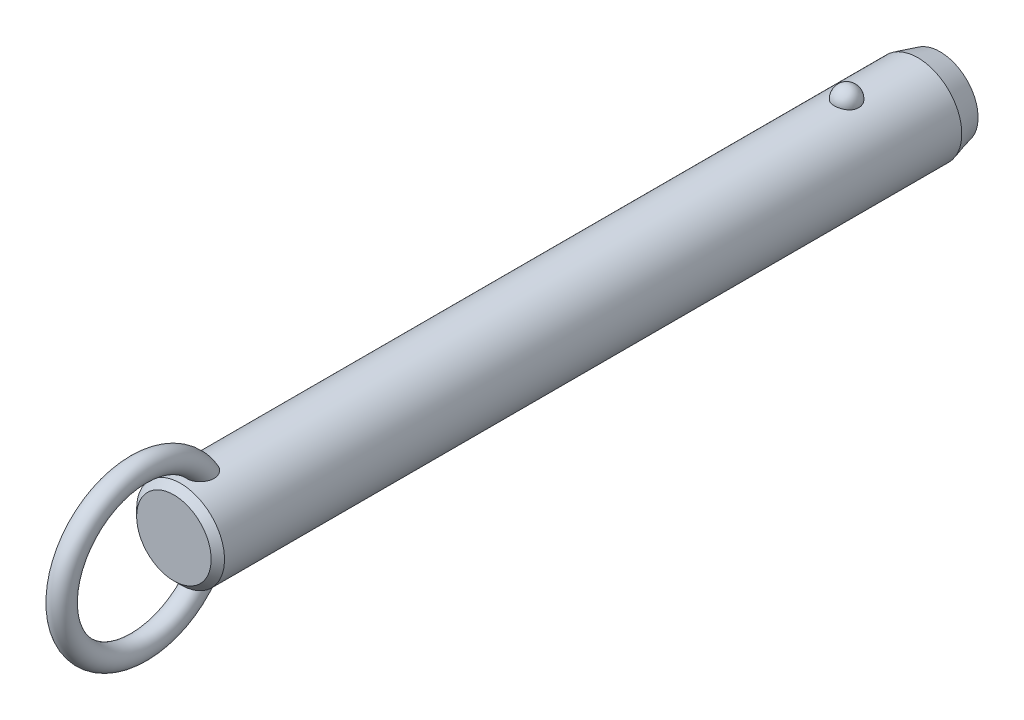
ISO-10303-21;
HEADER;
FILE_DESCRIPTION(('STEP AP214'),'2;1');
FILE_NAME('part.step','',(''),(''),'','','');
FILE_SCHEMA(('AUTOMOTIVE_DESIGN { 1 0 10303 214 1 1 1 1 }'));
ENDSEC;
DATA;
#1=APPLICATION_CONTEXT('core data for automotive mechanical design processes');
#2=APPLICATION_PROTOCOL_DEFINITION('international standard','automotive_design',2000,#1);
#3=PRODUCT_CONTEXT('',#1,'mechanical');
#4=PRODUCT('Part','Part','',(#3));
#5=PRODUCT_RELATED_PRODUCT_CATEGORY('part','',(#4));
#6=PRODUCT_DEFINITION_FORMATION('','',#4);
#7=PRODUCT_DEFINITION_CONTEXT('part definition',#1,'design');
#8=PRODUCT_DEFINITION('design','',#6,#7);
#9=PRODUCT_DEFINITION_SHAPE('','',#8);
#10=(LENGTH_UNIT() NAMED_UNIT(*) SI_UNIT(.MILLI.,.METRE.));
#11=(NAMED_UNIT(*) PLANE_ANGLE_UNIT() SI_UNIT($,.RADIAN.));
#12=(NAMED_UNIT(*) SI_UNIT($,.STERADIAN.) SOLID_ANGLE_UNIT());
#13=UNCERTAINTY_MEASURE_WITH_UNIT(LENGTH_MEASURE(1.E-05),#10,'distance_accuracy_value','');
#14=(GEOMETRIC_REPRESENTATION_CONTEXT(3) GLOBAL_UNCERTAINTY_ASSIGNED_CONTEXT((#13)) GLOBAL_UNIT_ASSIGNED_CONTEXT((#10,
#11,#12)) REPRESENTATION_CONTEXT('',''));
#15=CARTESIAN_POINT('',(0.,0.,0.));
#16=DIRECTION('',(0.,0.,1.));
#17=DIRECTION('',(1.,0.,0.));
#18=AXIS2_PLACEMENT_3D('',#15,#16,#17);
#19=CARTESIAN_POINT('',(0.,0.,109.2));
#20=DIRECTION('',(0.,0.,-1.));
#21=DIRECTION('',(-1.,0.,0.));
#22=AXIS2_PLACEMENT_3D('',#19,#20,#21);
#23=CYLINDRICAL_SURFACE('',#22,7.9);
#24=CARTESIAN_POINT('',(2.1785689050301,7.59367088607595,-2.19999999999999));
#25=CARTESIAN_POINT('',(2.17856679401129,7.59367269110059,-2.07701843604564));
#26=CARTESIAN_POINT('',(2.16853481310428,7.59657145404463,-1.95401006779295));
#27=CARTESIAN_POINT('',(2.12864689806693,7.607843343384,-1.71147811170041));
#28=CARTESIAN_POINT('',(2.09878338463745,7.61621856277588,-1.59195587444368));
#29=CARTESIAN_POINT('',(2.0199931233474,7.63749180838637,-1.3598563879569));
#30=CARTESIAN_POINT('',(1.97107475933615,7.6503878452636,-1.24727610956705));
#31=CARTESIAN_POINT('',(1.85539377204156,7.67926115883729,-1.03213234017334));
#32=CARTESIAN_POINT('',(1.78863158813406,7.69523835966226,-0.929568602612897));
#33=CARTESIAN_POINT('',(1.63856494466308,7.7285848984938,-0.736786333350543));
#34=CARTESIAN_POINT('',(1.55518140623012,7.7459606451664,-0.646630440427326));
#35=CARTESIAN_POINT('',(1.37422937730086,7.78009978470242,-0.481747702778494));
#36=CARTESIAN_POINT('',(1.27666086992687,7.79686317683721,-0.407020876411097));
#37=CARTESIAN_POINT('',(1.07024728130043,7.82786153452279,-0.275278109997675));
#38=CARTESIAN_POINT('',(0.961434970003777,7.84210353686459,-0.218212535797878));
#39=CARTESIAN_POINT('',(0.735351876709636,7.86652194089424,-0.123146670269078));
#40=CARTESIAN_POINT('',(0.618082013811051,7.87669878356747,-0.085144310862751));
#41=CARTESIAN_POINT('',(0.380637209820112,7.89170521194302,-0.0298158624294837));
#42=CARTESIAN_POINT('',(0.260550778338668,7.89662650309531,-0.0121347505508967));
#43=CARTESIAN_POINT('',(0.0190117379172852,7.90090003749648,0.00324379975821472));
#44=CARTESIAN_POINT('',(-0.102440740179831,7.90025280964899,0.00094313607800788));
#45=CARTESIAN_POINT('',(-0.341452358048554,7.89351056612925,-0.0233955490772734));
#46=CARTESIAN_POINT('',(-0.459042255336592,7.88749257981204,-0.0451545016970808));
#47=CARTESIAN_POINT('',(-0.688796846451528,7.87075812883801,-0.107408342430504));
#48=CARTESIAN_POINT('',(-0.800961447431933,7.86004158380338,-0.147903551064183));
#49=CARTESIAN_POINT('',(-1.01743634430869,7.83497131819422,-0.246799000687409));
#50=CARTESIAN_POINT('',(-1.12169791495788,7.82059709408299,-0.305300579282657));
#51=CARTESIAN_POINT('',(-1.31891765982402,7.78976470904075,-0.438549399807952));
#52=CARTESIAN_POINT('',(-1.41187469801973,7.77330633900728,-0.513298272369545));
#53=CARTESIAN_POINT('',(-1.58577142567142,7.73972434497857,-0.678622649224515));
#54=CARTESIAN_POINT('',(-1.66645140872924,7.72259402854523,-0.769470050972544));
#55=CARTESIAN_POINT('',(-1.81161503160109,7.68983776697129,-0.963538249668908));
#56=CARTESIAN_POINT('',(-1.87609753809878,7.6742119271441,-1.06675991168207));
#57=CARTESIAN_POINT('',(-1.98790138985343,7.6460202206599,-1.28401170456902));
#58=CARTESIAN_POINT('',(-2.03501994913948,7.63349104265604,-1.39815107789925));
#59=CARTESIAN_POINT('',(-2.10986724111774,7.6131449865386,-1.63301784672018));
#60=CARTESIAN_POINT('',(-2.1375965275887,7.60532797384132,-1.75374505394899));
#61=CARTESIAN_POINT('',(-2.17289256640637,7.5953195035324,-1.99782562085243));
#62=CARTESIAN_POINT('',(-2.18054294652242,7.59310471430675,-2.12116592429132));
#63=CARTESIAN_POINT('',(-2.17572919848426,7.59448538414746,-2.36741799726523));
#64=CARTESIAN_POINT('',(-2.1632656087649,7.59808068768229,-2.49032977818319));
#65=CARTESIAN_POINT('',(-2.11865035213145,7.61064035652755,-2.73161015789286));
#66=CARTESIAN_POINT('',(-2.08659579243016,7.61957823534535,-2.84999812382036));
#67=CARTESIAN_POINT('',(-2.00367799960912,7.64179982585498,-3.07955956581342));
#68=CARTESIAN_POINT('',(-1.9528140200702,7.65508371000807,-3.19073275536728));
#69=CARTESIAN_POINT('',(-1.83321113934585,7.68460381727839,-3.40337899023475));
#70=CARTESIAN_POINT('',(-1.76437735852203,7.70085556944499,-3.50479651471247));
#71=CARTESIAN_POINT('',(-1.61069526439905,7.73445734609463,-3.69446912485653));
#72=CARTESIAN_POINT('',(-1.52584634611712,7.75180741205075,-3.78272371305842));
#73=CARTESIAN_POINT('',(-1.34198059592,7.78574608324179,-3.94393987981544));
#74=CARTESIAN_POINT('',(-1.24291308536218,7.80233167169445,-4.01684434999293));
#75=CARTESIAN_POINT('',(-1.03352039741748,7.83281625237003,-4.14489386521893));
#76=CARTESIAN_POINT('',(-0.92319600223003,7.84671543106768,-4.20004014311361));
#77=CARTESIAN_POINT('',(-0.695822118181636,7.87011575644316,-4.29042017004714));
#78=CARTESIAN_POINT('',(-0.578872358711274,7.87966903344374,-4.32589112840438));
#79=CARTESIAN_POINT('',(-0.340410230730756,7.8935652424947,-4.37692226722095));
#80=CARTESIAN_POINT('',(-0.218898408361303,7.89790879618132,-4.39248482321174));
#81=CARTESIAN_POINT('',(0.0228107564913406,7.90087453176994,-4.40314405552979));
#82=CARTESIAN_POINT('',(0.142990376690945,7.89960185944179,-4.39861683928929));
#83=CARTESIAN_POINT('',(0.380829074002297,7.89171262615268,-4.37008293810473));
#84=CARTESIAN_POINT('',(0.498488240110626,7.8850962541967,-4.34607694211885));
#85=CARTESIAN_POINT('',(0.727535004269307,7.86726442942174,-4.27939317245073));
#86=CARTESIAN_POINT('',(0.838944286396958,7.85606616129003,-4.236785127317));
#87=CARTESIAN_POINT('',(1.05295421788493,7.83025654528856,-4.13408348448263));
#88=CARTESIAN_POINT('',(1.15555431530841,7.81564498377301,-4.07398879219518));
#89=CARTESIAN_POINT('',(1.35076763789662,7.7843022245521,-3.93687432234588));
#90=CARTESIAN_POINT('',(1.4432046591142,7.76754209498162,-3.85961036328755));
#91=CARTESIAN_POINT('',(1.6139111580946,7.73387857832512,-3.69076949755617));
#92=CARTESIAN_POINT('',(1.6921781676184,7.71697516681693,-3.59919010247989));
#93=CARTESIAN_POINT('',(1.83380875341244,7.6845643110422,-3.40247278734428));
#94=CARTESIAN_POINT('',(1.89689280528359,7.66908588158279,-3.29712873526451));
#95=CARTESIAN_POINT('',(2.0047823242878,7.64159441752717,-3.07707931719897));
#96=CARTESIAN_POINT('',(2.0495945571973,7.62958010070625,-2.96237743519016));
#97=CARTESIAN_POINT('',(2.11580183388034,7.61146617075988,-2.74040519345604));
#98=CARTESIAN_POINT('',(2.13929812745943,7.60484503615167,-2.63379846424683));
#99=CARTESIAN_POINT('',(2.17068242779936,7.59594664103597,-2.41813481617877));
#100=CARTESIAN_POINT('',(2.17857077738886,7.59366928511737,-2.30907795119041));
#101=CARTESIAN_POINT('',(2.1785689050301,7.59367088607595,-2.19999999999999));
#102=B_SPLINE_CURVE_WITH_KNOTS('',3,(#24,#25,#26,#27,#28,#29,#30,#31,#32,#33,#34,#35,#36,#37,
#38,#39,#40,#41,#42,#43,#44,#45,#46,#47,#48,#49,#50,#51,#52,#53,#54,#55,#56,#57,#58,#59,#60,#61,
#62,#63,#64,#65,#66,#67,#68,#69,#70,#71,#72,#73,#74,#75,#76,#77,#78,#79,#80,#81,#82,#83,#84,#85,
#86,#87,#88,#89,#90,#91,#92,#93,#94,#95,#96,#97,#98,#99,#100,#101),.UNSPECIFIED.,.T.,.F.,(4,2,2,
2,2,2,2,2,2,2,2,2,2,2,2,2,2,2,2,2,2,2,2,2,2,2,2,2,2,2,2,2,2,2,2,2,2,2,4),(0.,0.368552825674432,
0.737246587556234,1.10577831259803,1.4743009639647,1.8446206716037,2.21494081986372,
2.5842105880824,2.95344028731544,3.31611630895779,3.67875788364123,4.03628044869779,
4.39380913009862,4.75338791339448,5.11300280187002,5.47939989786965,5.8458226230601,
6.21639834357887,6.58696347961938,6.95598276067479,7.32499216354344,7.69218715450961,
8.0593967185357,8.42858578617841,8.79778880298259,9.16834203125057,9.5388695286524,
9.90482699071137,10.2707407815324,10.6298333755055,10.9889132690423,11.3466585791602,
11.7044262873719,12.0676511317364,12.4309391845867,12.8004764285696,13.1698767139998,
13.4967701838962,13.8236564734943),.UNSPECIFIED.);
#103=CARTESIAN_POINT('',(2.1785689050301,7.59367088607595,-2.19999999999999));
#104=VERTEX_POINT('',#103);
#105=EDGE_CURVE('E41',#104,#104,#102,.T.);
#106=ORIENTED_EDGE('',*,*,#105,.T.);
#107=EDGE_LOOP('',(#106));
#108=FACE_BOUND('',#107,.T.);
#109=CARTESIAN_POINT('',(0.,0.,117.52));
#110=DIRECTION('',(0.,0.,1.));
#111=DIRECTION('',(1.,0.,0.));
#112=AXIS2_PLACEMENT_3D('',#109,#110,#111);
#113=CIRCLE('',#112,7.9);
#114=CARTESIAN_POINT('',(-7.90000000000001,0.,117.52));
#115=VERTEX_POINT('',#114);
#116=EDGE_CURVE('E10',#115,#115,#113,.F.);
#117=ORIENTED_EDGE('',*,*,#116,.T.);
#118=EDGE_LOOP('',(#117));
#119=FACE_BOUND('',#118,.T.);
#120=CARTESIAN_POINT('',(-0.630969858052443,-7.87476203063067,111.412432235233));
#121=CARTESIAN_POINT('',(-0.734180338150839,-7.8664899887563,111.447285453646));
#122=CARTESIAN_POINT('',(-0.834476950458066,-7.85639291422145,111.490816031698));
#123=CARTESIAN_POINT('',(-1.0262035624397,-7.83366343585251,111.594094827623));
#124=CARTESIAN_POINT('',(-1.1176141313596,-7.82102565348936,111.653877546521));
#125=CARTESIAN_POINT('',(-1.28877277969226,-7.79464922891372,111.787839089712));
#126=CARTESIAN_POINT('',(-1.36854014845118,-7.78091246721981,111.861993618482));
#127=CARTESIAN_POINT('',(-1.5146152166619,-7.75380398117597,112.022494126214));
#128=CARTESIAN_POINT('',(-1.58092966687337,-7.74043207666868,112.108833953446));
#129=CARTESIAN_POINT('',(-1.70019064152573,-7.71512522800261,112.292978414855));
#130=CARTESIAN_POINT('',(-1.75284037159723,-7.70322473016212,112.390979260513));
#131=CARTESIAN_POINT('',(-1.84263464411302,-7.68224112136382,112.594102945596));
#132=CARTESIAN_POINT('',(-1.87977299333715,-7.6731591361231,112.699228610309));
#133=CARTESIAN_POINT('',(-1.94152728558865,-7.65777930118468,112.923284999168));
#134=CARTESIAN_POINT('',(-1.96475471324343,-7.65179654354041,113.042616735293));
#135=CARTESIAN_POINT('',(-1.99449499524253,-7.64409642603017,113.28342986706));
#136=CARTESIAN_POINT('',(-2.0010005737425,-7.64238092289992,113.404912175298));
#137=CARTESIAN_POINT('',(-1.99856014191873,-7.64302120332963,113.668340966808));
#138=CARTESIAN_POINT('',(-1.98680021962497,-7.64611845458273,113.81025654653));
#139=CARTESIAN_POINT('',(-1.9445777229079,-7.65696186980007,114.091118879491));
#140=CARTESIAN_POINT('',(-1.91409393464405,-7.66471330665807,114.230062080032));
#141=CARTESIAN_POINT('',(-1.82768670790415,-7.68582947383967,114.531939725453));
#142=CARTESIAN_POINT('',(-1.76772963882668,-7.70003779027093,114.693686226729));
#143=CARTESIAN_POINT('',(-1.65998501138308,-7.72371550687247,114.927695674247));
#144=CARTESIAN_POINT('',(-1.62107967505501,-7.73200670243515,115.004297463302));
#145=CARTESIAN_POINT('',(-1.53727726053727,-7.74910377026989,115.154079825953));
#146=CARTESIAN_POINT('',(-1.49238215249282,-7.75790947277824,115.227261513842));
#147=CARTESIAN_POINT('',(-1.3739705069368,-7.77993338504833,115.40288382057));
#148=CARTESIAN_POINT('',(-1.29690364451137,-7.79328473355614,115.502955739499));
#149=CARTESIAN_POINT('',(-1.1288548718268,-7.81939266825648,115.690714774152));
#150=CARTESIAN_POINT('',(-1.03789926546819,-7.83215032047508,115.778424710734));
#151=CARTESIAN_POINT('',(-0.869532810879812,-7.85231710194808,115.913414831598));
#152=CARTESIAN_POINT('',(-0.795716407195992,-7.86021093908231,115.965076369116));
#153=CARTESIAN_POINT('',(-0.64081313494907,-7.87434920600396,116.056381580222));
#154=CARTESIAN_POINT('',(-0.559737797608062,-7.88059619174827,116.09604389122));
#155=CARTESIAN_POINT('',(-0.406456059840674,-7.88984116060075,116.154300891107));
#156=CARTESIAN_POINT('',(-0.335227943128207,-7.89321892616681,116.175384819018));
#157=CARTESIAN_POINT('',(-0.190193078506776,-7.89804235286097,116.20541418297));
#158=CARTESIAN_POINT('',(-0.116388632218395,-7.89948969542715,116.214370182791));
#159=CARTESIAN_POINT('',(0.0318414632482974,-7.90028409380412,116.219291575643));
#160=CARTESIAN_POINT('',(0.106268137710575,-7.89962640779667,116.215227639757));
#161=CARTESIAN_POINT('',(0.2532906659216,-7.8962818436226,116.194461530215));
#162=CARTESIAN_POINT('',(0.325885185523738,-7.8935935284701,116.177750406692));
#163=CARTESIAN_POINT('',(0.4814417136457,-7.88577340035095,116.128738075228));
#164=CARTESIAN_POINT('',(0.563611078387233,-7.88026321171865,116.094005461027));
#165=CARTESIAN_POINT('',(0.721129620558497,-7.86741729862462,116.011796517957));
#166=CARTESIAN_POINT('',(0.79646633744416,-7.86007832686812,115.964297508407));
#167=CARTESIAN_POINT('',(0.971456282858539,-7.84073285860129,115.836513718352));
#168=CARTESIAN_POINT('',(1.06719686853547,-7.82809461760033,115.751004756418));
#169=CARTESIAN_POINT('',(1.24418921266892,-7.80192439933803,115.566232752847));
#170=CARTESIAN_POINT('',(1.32540832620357,-7.78839049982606,115.466939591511));
#171=CARTESIAN_POINT('',(1.45199971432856,-7.76559693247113,115.289576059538));
#172=CARTESIAN_POINT('',(1.50085649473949,-7.75626094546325,115.213954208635));
#173=CARTESIAN_POINT('',(1.59197749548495,-7.7380727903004,115.058742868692));
#174=CARTESIAN_POINT('',(1.63423919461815,-7.72922080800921,114.979151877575));
#175=CARTESIAN_POINT('',(1.7122261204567,-7.71231959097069,114.816664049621));
#176=CARTESIAN_POINT('',(1.74794516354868,-7.70427111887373,114.733764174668));
#177=CARTESIAN_POINT('',(1.81270113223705,-7.68929240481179,114.5652967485));
#178=CARTESIAN_POINT('',(1.84173789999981,-7.68236218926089,114.479729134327));
#179=CARTESIAN_POINT('',(1.89322698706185,-7.6698375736,114.30528702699));
#180=CARTESIAN_POINT('',(1.91558744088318,-7.66426199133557,114.216383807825));
#181=CARTESIAN_POINT('',(1.95281367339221,-7.65485915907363,114.036969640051));
#182=CARTESIAN_POINT('',(1.96767946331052,-7.65103190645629,113.946458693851));
#183=CARTESIAN_POINT('',(2.00021456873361,-7.64262981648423,113.673732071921));
#184=CARTESIAN_POINT('',(2.00600691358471,-7.6410871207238,113.489709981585));
#185=CARTESIAN_POINT('',(1.98445334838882,-7.64669564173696,113.176501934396));
#186=CARTESIAN_POINT('',(1.96607186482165,-7.65149688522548,113.046618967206));
#187=CARTESIAN_POINT('',(1.90884967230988,-7.6659762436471,112.791632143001));
#188=CARTESIAN_POINT('',(1.87002101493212,-7.67565148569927,112.666525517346));
#189=CARTESIAN_POINT('',(1.77063986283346,-7.69918471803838,112.42454013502));
#190=CARTESIAN_POINT('',(1.70993724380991,-7.71307150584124,112.307725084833));
#191=CARTESIAN_POINT('',(1.56733070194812,-7.74330306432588,112.088144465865));
#192=CARTESIAN_POINT('',(1.48543692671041,-7.75964665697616,111.985372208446));
#193=CARTESIAN_POINT('',(1.31346177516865,-7.79047523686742,111.809380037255));
#194=CARTESIAN_POINT('',(1.22547278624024,-7.80495298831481,111.734106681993));
#195=CARTESIAN_POINT('',(1.03724352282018,-7.83218597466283,111.600486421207));
#196=CARTESIAN_POINT('',(0.937008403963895,-7.84494192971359,111.542132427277));
#197=CARTESIAN_POINT('',(0.733599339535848,-7.86649045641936,111.447027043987));
#198=CARTESIAN_POINT('',(0.630941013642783,-7.87547134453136,111.409210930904));
#199=CARTESIAN_POINT('',(0.420465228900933,-7.88950708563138,111.351116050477));
#200=CARTESIAN_POINT('',(0.312645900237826,-7.89456050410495,111.33084369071));
#201=CARTESIAN_POINT('',(0.0960869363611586,-7.9001518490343,111.308455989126));
#202=CARTESIAN_POINT('',(-0.0126341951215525,-7.90073226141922,111.306169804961));
#203=CARTESIAN_POINT('',(-0.228766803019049,-7.89742350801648,111.319367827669));
#204=CARTESIAN_POINT('',(-0.33618060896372,-7.89354403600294,111.334813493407));
#205=CARTESIAN_POINT('',(-0.473410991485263,-7.88586871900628,111.366217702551));
#206=CARTESIAN_POINT('',(-0.505257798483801,-7.88388984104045,111.374354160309));
#207=CARTESIAN_POINT('',(-0.568481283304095,-7.87958326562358,111.392208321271));
#208=CARTESIAN_POINT('',(-0.599857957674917,-7.87725556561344,111.401926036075));
#209=CARTESIAN_POINT('',(-0.630969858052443,-7.87476203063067,111.412432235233));
#210=B_SPLINE_CURVE_WITH_KNOTS('',3,(#120,#121,#122,#123,#124,#125,#126,#127,#128,#129,#130,
#131,#132,#133,#134,#135,#136,#137,#138,#139,#140,#141,#142,#143,#144,#145,#146,#147,#148,#149,
#150,#151,#152,#153,#154,#155,#156,#157,#158,#159,#160,#161,#162,#163,#164,#165,#166,#167,#168,
#169,#170,#171,#172,#173,#174,#175,#176,#177,#178,#179,#180,#181,#182,#183,#184,#185,#186,#187,
#188,#189,#190,#191,#192,#193,#194,#195,#196,#197,#198,#199,#200,#201,#202,#203,#204,#205,#206,
#207,#208,#209),.UNSPECIFIED.,.T.,.F.,(4,2,2,2,2,2,2,2,2,2,2,2,2,2,2,2,2,2,2,2,2,2,2,2,2,2,2,2,
2,2,2,2,2,2,2,2,2,2,2,2,2,2,2,2,4),(0.,0.327622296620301,0.655945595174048,0.983718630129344,
1.3113267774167,1.64554655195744,1.9798996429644,2.34365728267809,2.70757317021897,
3.13333684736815,3.55958380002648,4.07655306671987,4.33527897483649,4.59391999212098,
4.9738243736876,5.35301797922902,5.62348245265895,5.89352465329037,6.11565959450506,
6.3376009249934,6.56004255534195,6.782641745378,7.04930844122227,7.31645206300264,
7.70130871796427,8.08701995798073,8.35824509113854,8.62957365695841,8.90115735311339,
9.17274746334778,9.44791855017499,9.72308922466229,10.2715298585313,10.6638393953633,
11.0559179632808,11.4507403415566,11.845374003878,12.1936425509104,12.5417649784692,
12.8695063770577,13.1973674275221,13.5221104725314,13.8461490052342,13.9449071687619,
14.0436660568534),.UNSPECIFIED.);
#211=CARTESIAN_POINT('',(-0.630969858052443,-7.87476203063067,111.412432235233));
#212=VERTEX_POINT('',#211);
#213=EDGE_CURVE('E59',#212,#212,#210,.T.);
#214=ORIENTED_EDGE('',*,*,#213,.T.);
#215=EDGE_LOOP('',(#214));
#216=FACE_BOUND('',#215,.T.);
#217=CARTESIAN_POINT('',(-0.630969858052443,7.87476203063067,111.412432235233));
#218=CARTESIAN_POINT('',(-0.52891882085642,7.88293636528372,111.377979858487));
#219=CARTESIAN_POINT('',(-0.423745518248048,7.8893481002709,111.351915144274));
#220=CARTESIAN_POINT('',(-0.210236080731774,7.8979273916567,111.317282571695));
#221=CARTESIAN_POINT('',(-0.101893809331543,7.90008607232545,111.308751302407));
#222=CARTESIAN_POINT('',(0.114660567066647,7.89990877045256,111.309457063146));
#223=CARTESIAN_POINT('',(0.222872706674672,7.89757640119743,111.31867980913));
#224=CARTESIAN_POINT('',(0.436107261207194,7.88867538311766,111.354652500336));
#225=CARTESIAN_POINT('',(0.541131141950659,7.8821087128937,111.38139425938));
#226=CARTESIAN_POINT('',(0.745085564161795,7.86545130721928,111.451756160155));
#227=CARTESIAN_POINT('',(0.844015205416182,7.85536005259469,111.495378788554));
#228=CARTESIAN_POINT('',(1.03299167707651,7.83275153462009,111.598379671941));
#229=CARTESIAN_POINT('',(1.12303841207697,7.8202342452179,111.657758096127));
#230=CARTESIAN_POINT('',(1.29214734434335,7.79408219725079,111.790864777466));
#231=CARTESIAN_POINT('',(1.37116907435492,7.78044359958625,111.864643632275));
#232=CARTESIAN_POINT('',(1.51597677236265,7.75353170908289,112.024235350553));
#233=CARTESIAN_POINT('',(1.58176261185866,7.74025841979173,112.110048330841));
#234=CARTESIAN_POINT('',(1.70057386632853,7.71504069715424,112.293644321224));
#235=CARTESIAN_POINT('',(1.75320073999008,7.70314257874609,112.391690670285));
#236=CARTESIAN_POINT('',(1.84293767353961,7.68216822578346,112.594893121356));
#237=CARTESIAN_POINT('',(1.88004278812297,7.67309289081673,112.700051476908));
#238=CARTESIAN_POINT('',(1.9417232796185,7.6577294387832,112.924167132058));
#239=CARTESIAN_POINT('',(1.96491037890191,7.65175648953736,113.043524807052));
#240=CARTESIAN_POINT('',(1.9945689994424,7.64407702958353,113.284384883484));
#241=CARTESIAN_POINT('',(2.00103304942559,7.64237242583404,113.40588821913));
#242=CARTESIAN_POINT('',(1.99850166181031,7.64303650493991,113.669368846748));
#243=CARTESIAN_POINT('',(1.98669038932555,7.64614714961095,113.811314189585));
#244=CARTESIAN_POINT('',(1.94436120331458,7.6570170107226,114.092228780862));
#245=CARTESIAN_POINT('',(1.91382203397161,7.66478150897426,114.231194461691));
#246=CARTESIAN_POINT('',(1.82728754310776,7.68592483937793,114.533111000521));
#247=CARTESIAN_POINT('',(1.76725778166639,7.7001468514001,114.694872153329));
#248=CARTESIAN_POINT('',(1.65939700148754,7.72384204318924,114.928891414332));
#249=CARTESIAN_POINT('',(1.62045187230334,7.73213852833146,115.005494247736));
#250=CARTESIAN_POINT('',(1.53656684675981,7.74924489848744,115.155273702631));
#251=CARTESIAN_POINT('',(1.49162892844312,7.75805461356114,115.228451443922));
#252=CARTESIAN_POINT('',(1.37317698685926,7.78007342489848,115.403952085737));
#253=CARTESIAN_POINT('',(1.29612360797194,7.79341423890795,115.503911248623));
#254=CARTESIAN_POINT('',(1.12812043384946,7.81949839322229,115.69145083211));
#255=CARTESIAN_POINT('',(1.03719688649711,7.83224280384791,115.779054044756));
#256=CARTESIAN_POINT('',(0.868871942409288,7.85239026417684,115.91389715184));
#257=CARTESIAN_POINT('',(0.795056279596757,7.86027769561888,115.965511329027));
#258=CARTESIAN_POINT('',(0.640160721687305,7.87440222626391,116.056720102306));
#259=CARTESIAN_POINT('',(0.559092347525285,7.88064188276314,116.096333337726));
#260=CARTESIAN_POINT('',(0.405820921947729,7.8898738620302,116.154505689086));
#261=CARTESIAN_POINT('',(0.334594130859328,7.89324577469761,116.175552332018));
#262=CARTESIAN_POINT('',(0.189568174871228,7.89805733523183,116.205507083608));
#263=CARTESIAN_POINT('',(0.115771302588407,7.89949866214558,116.214425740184));
#264=CARTESIAN_POINT('',(-0.0324359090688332,7.90028156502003,116.21927589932));
#265=CARTESIAN_POINT('',(-0.106847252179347,7.89961843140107,116.215178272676));
#266=CARTESIAN_POINT('',(-0.253834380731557,7.8962642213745,116.194351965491));
#267=CARTESIAN_POINT('',(-0.326408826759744,7.89357170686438,116.177614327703));
#268=CARTESIAN_POINT('',(-0.481962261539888,7.88574179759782,116.128539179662));
#269=CARTESIAN_POINT('',(-0.564145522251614,7.88022507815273,116.093763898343));
#270=CARTESIAN_POINT('',(-0.721685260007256,7.8673664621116,116.011468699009));
#271=CARTESIAN_POINT('',(-0.797029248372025,7.8600213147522,115.963926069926));
#272=CARTESIAN_POINT('',(-0.97204426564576,7.84066026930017,115.836026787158));
#273=CARTESIAN_POINT('',(-1.06779803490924,7.82801274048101,115.750443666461));
#274=CARTESIAN_POINT('',(-1.24480531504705,7.80182621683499,115.565522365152));
#275=CARTESIAN_POINT('',(-1.32602618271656,7.78828530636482,115.466154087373));
#276=CARTESIAN_POINT('',(-1.45259834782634,7.76548487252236,115.288680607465));
#277=CARTESIAN_POINT('',(-1.50143856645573,7.75614818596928,115.213025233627));
#278=CARTESIAN_POINT('',(-1.59252410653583,7.7379602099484,115.057748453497));
#279=CARTESIAN_POINT('',(-1.63476690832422,7.72910910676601,114.978125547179));
#280=CARTESIAN_POINT('',(-1.71271318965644,7.71221133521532,114.815575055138));
#281=CARTESIAN_POINT('',(-1.74841047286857,7.70416543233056,114.732644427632));
#282=CARTESIAN_POINT('',(-1.81311929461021,7.68919371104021,114.564116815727));
#283=CARTESIAN_POINT('',(-1.84213067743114,7.6822679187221,114.478519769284));
#284=CARTESIAN_POINT('',(-1.89356259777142,7.66975461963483,114.304025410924));
#285=CARTESIAN_POINT('',(-1.91589165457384,7.66418586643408,114.215099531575));
#286=CARTESIAN_POINT('',(-1.95305070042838,7.65479859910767,114.035642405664));
#287=CARTESIAN_POINT('',(-1.96788069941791,7.65098008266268,113.945111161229));
#288=CARTESIAN_POINT('',(-2.00030078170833,7.64260704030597,113.672327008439));
#289=CARTESIAN_POINT('',(-2.00600576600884,7.64108760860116,113.488271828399));
#290=CARTESIAN_POINT('',(-1.98428483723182,7.64673945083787,113.175080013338));
#291=CARTESIAN_POINT('',(-1.96583698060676,7.6515575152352,113.045240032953));
#292=CARTESIAN_POINT('',(-1.9084894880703,7.66606613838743,112.790361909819));
#293=CARTESIAN_POINT('',(-1.86960376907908,7.67575338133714,112.665320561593));
#294=CARTESIAN_POINT('',(-1.77013421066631,7.69930132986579,112.423500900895));
#295=CARTESIAN_POINT('',(-1.7094048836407,7.71318991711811,112.306784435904));
#296=CARTESIAN_POINT('',(-1.56672953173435,7.74342495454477,112.087340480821));
#297=CARTESIAN_POINT('',(-1.48478316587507,7.75977144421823,111.98461321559));
#298=CARTESIAN_POINT('',(-1.31266325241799,7.79061163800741,111.808643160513));
#299=CARTESIAN_POINT('',(-1.22456383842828,7.80509908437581,111.733358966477));
#300=CARTESIAN_POINT('',(-1.03622400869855,7.83231881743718,111.599865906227));
#301=CARTESIAN_POINT('',(-0.936015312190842,7.84505551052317,111.541613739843));
#302=CARTESIAN_POINT('',(-0.798824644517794,7.85957802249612,111.477540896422));
#303=CARTESIAN_POINT('',(-0.765787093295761,7.8628682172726,111.463224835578));
#304=CARTESIAN_POINT('',(-0.698939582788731,7.86909211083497,111.436436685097));
#305=CARTESIAN_POINT('',(-0.665129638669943,7.8720258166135,111.423964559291));
#306=CARTESIAN_POINT('',(-0.630969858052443,7.87476203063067,111.412432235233));
#307=B_SPLINE_CURVE_WITH_KNOTS('',3,(#217,#218,#219,#220,#221,#222,#223,#224,#225,#226,#227,
#228,#229,#230,#231,#232,#233,#234,#235,#236,#237,#238,#239,#240,#241,#242,#243,#244,#245,#246,
#247,#248,#249,#250,#251,#252,#253,#254,#255,#256,#257,#258,#259,#260,#261,#262,#263,#264,#265,
#266,#267,#268,#269,#270,#271,#272,#273,#274,#275,#276,#277,#278,#279,#280,#281,#282,#283,#284,
#285,#286,#287,#288,#289,#290,#291,#292,#293,#294,#295,#296,#297,#298,#299,#300,#301,#302,#303,
#304,#305,#306),.UNSPECIFIED.,.T.,.F.,(4,2,2,2,2,2,2,2,2,2,2,2,2,2,2,2,2,2,2,2,2,2,2,2,2,2,2,2,
2,2,2,2,2,2,2,2,2,2,2,2,2,2,2,2,4),(0.,0.32392037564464,0.648516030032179,0.97285063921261,
1.29703380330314,1.62126473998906,1.94549915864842,2.27089401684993,2.5962920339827,
2.93059633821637,3.26500707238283,3.6288164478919,3.99278833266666,4.41865421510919,
4.84500434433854,5.36209210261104,5.62087589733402,5.87957448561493,6.2591859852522,
6.63808782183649,6.90846748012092,7.17842501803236,7.40052350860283,7.62242871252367,
7.84483086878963,8.06739077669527,8.33414615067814,8.60137921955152,8.98641454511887,
9.37230415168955,9.64358673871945,9.9149726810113,10.1866142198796,10.458262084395,
10.7334745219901,11.0086865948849,11.5572126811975,11.9494246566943,12.3413699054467,
12.7359755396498,13.1305875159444,13.4791770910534,13.82687259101,13.9353013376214,
14.0437279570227),.UNSPECIFIED.);
#308=CARTESIAN_POINT('',(-0.630969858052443,7.87476203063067,111.412432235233));
#309=VERTEX_POINT('',#308);
#310=EDGE_CURVE('E67',#309,#309,#307,.T.);
#311=ORIENTED_EDGE('',*,*,#310,.T.);
#312=EDGE_LOOP('',(#311));
#313=FACE_BOUND('',#312,.T.);
#314=CARTESIAN_POINT('',(0.,0.,-14.9999999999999));
#315=DIRECTION('',(0.,0.,-1.));
#316=DIRECTION('',(-1.,0.,0.));
#317=AXIS2_PLACEMENT_3D('',#314,#315,#316);
#318=CIRCLE('',#317,7.9);
#319=CARTESIAN_POINT('',(-7.9,0.,-14.9999999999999));
#320=VERTEX_POINT('',#319);
#321=EDGE_CURVE('E56',#320,#320,#318,.F.);
#322=ORIENTED_EDGE('',*,*,#321,.T.);
#323=EDGE_LOOP('',(#322));
#324=FACE_BOUND('',#323,.T.);
#325=ADVANCED_FACE('F37',(#108,#119,#216,#313,#324),#23,.T.);
#326=CARTESIAN_POINT('',(0.,0.,-19.));
#327=DIRECTION('',(0.,0.,-1.));
#328=DIRECTION('',(-1.,0.,0.));
#329=AXIS2_PLACEMENT_3D('',#326,#327,#328);
#330=PLANE('',#329);
#331=CARTESIAN_POINT('',(0.,0.,-19.));
#332=DIRECTION('',(0.,0.,-1.));
#333=DIRECTION('',(-1.,0.,0.));
#334=AXIS2_PLACEMENT_3D('',#331,#332,#333);
#335=CIRCLE('',#334,6.8282032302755);
#336=CARTESIAN_POINT('',(-6.8282032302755,0.,-19.));
#337=VERTEX_POINT('',#336);
#338=EDGE_CURVE('E66',#337,#337,#335,.T.);
#339=ORIENTED_EDGE('',*,*,#338,.T.);
#340=EDGE_LOOP('',(#339));
#341=FACE_BOUND('',#340,.T.);
#342=ADVANCED_FACE('F85',(#341),#330,.T.);
#343=CARTESIAN_POINT('',(0.,0.,-19.));
#344=DIRECTION('',(0.,0.,1.));
#345=DIRECTION('',(1.,0.,0.));
#346=AXIS2_PLACEMENT_3D('',#343,#344,#345);
#347=CONICAL_SURFACE('',#346,6.8282032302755,0.261799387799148);
#348=ORIENTED_EDGE('',*,*,#321,.F.);
#349=EDGE_LOOP('',(#348));
#350=FACE_BOUND('',#349,.T.);
#351=ORIENTED_EDGE('',*,*,#338,.F.);
#352=EDGE_LOOP('',(#351));
#353=FACE_BOUND('',#352,.T.);
#354=ADVANCED_FACE('F83',(#350,#353),#347,.T.);
#355=CARTESIAN_POINT('',(0.,0.,118.72));
#356=DIRECTION('',(0.,0.,1.));
#357=DIRECTION('',(1.,0.,0.));
#358=AXIS2_PLACEMENT_3D('',#355,#356,#357);
#359=PLANE('',#358);
#360=CARTESIAN_POINT('',(0.,0.,118.72));
#361=DIRECTION('',(0.,0.,1.));
#362=DIRECTION('',(1.,0.,0.));
#363=AXIS2_PLACEMENT_3D('',#360,#361,#362);
#364=CIRCLE('',#363,6.69999999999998);
#365=CARTESIAN_POINT('',(-6.69999999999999,0.,118.72));
#366=VERTEX_POINT('',#365);
#367=EDGE_CURVE('E50',#366,#366,#364,.T.);
#368=ORIENTED_EDGE('',*,*,#367,.T.);
#369=EDGE_LOOP('',(#368));
#370=FACE_BOUND('',#369,.T.);
#371=ADVANCED_FACE('F77',(#370),#359,.T.);
#372=CARTESIAN_POINT('',(0.,0.,125.05));
#373=DIRECTION('',(1.,0.,0.));
#374=DIRECTION('',(0.,0.,-1.));
#375=AXIS2_PLACEMENT_3D('',#372,#373,#374);
#376=TOROIDAL_SURFACE('',#375,13.85,2.);
#377=ORIENTED_EDGE('',*,*,#310,.F.);
#378=EDGE_LOOP('',(#377));
#379=FACE_BOUND('',#378,.T.);
#380=ORIENTED_EDGE('',*,*,#213,.F.);
#381=EDGE_LOOP('',(#380));
#382=FACE_BOUND('',#381,.T.);
#383=ADVANCED_FACE('F73',(#379,#382),#376,.T.);
#384=CARTESIAN_POINT('',(0.,0.,118.72));
#385=DIRECTION('',(0.,0.,-1.));
#386=DIRECTION('',(-1.,0.,0.));
#387=AXIS2_PLACEMENT_3D('',#384,#385,#386);
#388=CONICAL_SURFACE('',#387,6.69999999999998,0.785398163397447);
#389=CARTESIAN_POINT('',(-7.90000000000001,0.,117.52));
#390=CARTESIAN_POINT('',(-7.88750000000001,0.,117.5325));
#391=CARTESIAN_POINT('',(-7.87500000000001,0.,117.545));
#392=CARTESIAN_POINT('',(-7.85000000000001,0.,117.57));
#393=CARTESIAN_POINT('',(-7.83750000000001,0.,117.5825));
#394=CARTESIAN_POINT('',(-7.81250000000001,0.,117.6075));
#395=CARTESIAN_POINT('',(-7.80000000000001,0.,117.62));
#396=CARTESIAN_POINT('',(-7.77500000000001,0.,117.645));
#397=CARTESIAN_POINT('',(-7.76250000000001,0.,117.6575));
#398=CARTESIAN_POINT('',(-7.73750000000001,0.,117.6825));
#399=CARTESIAN_POINT('',(-7.725,0.,117.695));
#400=CARTESIAN_POINT('',(-7.7,0.,117.72));
#401=CARTESIAN_POINT('',(-7.68750000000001,0.,117.7325));
#402=CARTESIAN_POINT('',(-7.66250000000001,0.,117.7575));
#403=CARTESIAN_POINT('',(-7.65000000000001,0.,117.77));
#404=CARTESIAN_POINT('',(-7.625,0.,117.795));
#405=CARTESIAN_POINT('',(-7.6125,0.,117.8075));
#406=CARTESIAN_POINT('',(-7.5875,0.,117.8325));
#407=CARTESIAN_POINT('',(-7.575,0.,117.845));
#408=CARTESIAN_POINT('',(-7.55,0.,117.87));
#409=CARTESIAN_POINT('',(-7.5375,0.,117.8825));
#410=CARTESIAN_POINT('',(-7.5125,0.,117.9075));
#411=CARTESIAN_POINT('',(-7.5,0.,117.92));
#412=CARTESIAN_POINT('',(-7.475,0.,117.945));
#413=CARTESIAN_POINT('',(-7.4625,0.,117.9575));
#414=CARTESIAN_POINT('',(-7.4375,0.,117.9825));
#415=CARTESIAN_POINT('',(-7.425,0.,117.995));
#416=CARTESIAN_POINT('',(-7.4,0.,118.02));
#417=CARTESIAN_POINT('',(-7.3875,0.,118.0325));
#418=CARTESIAN_POINT('',(-7.3625,0.,118.0575));
#419=CARTESIAN_POINT('',(-7.35,0.,118.07));
#420=CARTESIAN_POINT('',(-7.325,0.,118.095));
#421=CARTESIAN_POINT('',(-7.3125,0.,118.1075));
#422=CARTESIAN_POINT('',(-7.2875,0.,118.1325));
#423=CARTESIAN_POINT('',(-7.275,0.,118.145));
#424=CARTESIAN_POINT('',(-7.25,0.,118.17));
#425=CARTESIAN_POINT('',(-7.2375,0.,118.1825));
#426=CARTESIAN_POINT('',(-7.2125,0.,118.2075));
#427=CARTESIAN_POINT('',(-7.2,0.,118.22));
#428=CARTESIAN_POINT('',(-7.175,0.,118.245));
#429=CARTESIAN_POINT('',(-7.1625,0.,118.2575));
#430=CARTESIAN_POINT('',(-7.1375,0.,118.2825));
#431=CARTESIAN_POINT('',(-7.125,0.,118.295));
#432=CARTESIAN_POINT('',(-7.1,0.,118.32));
#433=CARTESIAN_POINT('',(-7.0875,0.,118.3325));
#434=CARTESIAN_POINT('',(-7.06249999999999,0.,118.3575));
#435=CARTESIAN_POINT('',(-7.04999999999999,0.,118.37));
#436=CARTESIAN_POINT('',(-7.02499999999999,0.,118.395));
#437=CARTESIAN_POINT('',(-7.0125,0.,118.4075));
#438=CARTESIAN_POINT('',(-6.9875,0.,118.4325));
#439=CARTESIAN_POINT('',(-6.975,0.,118.445));
#440=CARTESIAN_POINT('',(-6.94999999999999,0.,118.47));
#441=CARTESIAN_POINT('',(-6.93749999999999,0.,118.4825));
#442=CARTESIAN_POINT('',(-6.91249999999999,0.,118.5075));
#443=CARTESIAN_POINT('',(-6.9,0.,118.52));
#444=CARTESIAN_POINT('',(-6.87499999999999,0.,118.545));
#445=CARTESIAN_POINT('',(-6.86249999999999,0.,118.5575));
#446=CARTESIAN_POINT('',(-6.83749999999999,0.,118.5825));
#447=CARTESIAN_POINT('',(-6.82499999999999,0.,118.595));
#448=CARTESIAN_POINT('',(-6.79999999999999,0.,118.62));
#449=CARTESIAN_POINT('',(-6.78749999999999,0.,118.6325));
#450=CARTESIAN_POINT('',(-6.76249999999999,0.,118.6575));
#451=CARTESIAN_POINT('',(-6.74999999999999,0.,118.67));
#452=CARTESIAN_POINT('',(-6.72499999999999,0.,118.695));
#453=CARTESIAN_POINT('',(-6.71249999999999,0.,118.7075));
#454=CARTESIAN_POINT('',(-6.69999999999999,0.,118.72));
#455=B_SPLINE_CURVE_WITH_KNOTS('',3,(#389,#390,#391,#392,#393,#394,#395,#396,#397,#398,#399,
#400,#401,#402,#403,#404,#405,#406,#407,#408,#409,#410,#411,#412,#413,#414,#415,#416,#417,#418,
#419,#420,#421,#422,#423,#424,#425,#426,#427,#428,#429,#430,#431,#432,#433,#434,#435,#436,#437,
#438,#439,#440,#441,#442,#443,#444,#445,#446,#447,#448,#449,#450,#451,#452,#453,#454),
.UNSPECIFIED.,.F.,.F.,(4,2,2,2,2,2,2,2,2,2,2,2,2,2,2,2,2,2,2,2,2,2,2,2,2,2,2,2,2,2,2,2,4),(0.,
0.0530330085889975,0.106066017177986,0.159099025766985,0.212132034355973,0.265165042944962,
0.31819805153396,0.371231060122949,0.424264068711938,0.477297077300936,0.530330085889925,
0.583363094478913,0.636396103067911,0.6894291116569,0.742462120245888,0.795495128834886,
0.848528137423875,0.901561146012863,0.954594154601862,1.00762716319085,1.06066017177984,
1.11369318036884,1.16672618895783,1.21975919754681,1.27279220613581,1.3258252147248,
1.37885822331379,1.43189123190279,1.48492424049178,1.53795724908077,1.59099025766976,
1.64402326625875,1.69705627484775),.UNSPECIFIED.);
#456=EDGE_CURVE('BSEAM39',#115,#366,#455,.T.);
#457=ORIENTED_EDGE('',*,*,#116,.F.);
#458=ORIENTED_EDGE('',*,*,#367,.F.);
#459=ORIENTED_EDGE('',*,*,#456,.T.);
#460=ORIENTED_EDGE('',*,*,#456,.F.);
#461=EDGE_LOOP('',(#457,#459,#458,#460));
#462=FACE_BOUND('',#461,.T.);
#463=ADVANCED_FACE('F39',(#462),#388,.T.);
#464=CARTESIAN_POINT('',(0.,7.9,-2.19999999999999));
#465=DIRECTION('',(0.,1.,0.));
#466=DIRECTION('',(0.,0.,1.));
#467=AXIS2_PLACEMENT_3D('',#464,#465,#466);
#468=SPHERICAL_SURFACE('',#467,2.2);
#469=ORIENTED_EDGE('',*,*,#105,.F.);
#470=EDGE_LOOP('',(#469));
#471=FACE_BOUND('',#470,.T.);
#472=ADVANCED_FACE('F79',(#471),#468,.T.);
#473=CLOSED_SHELL('',(#325,#342,#354,#371,#383,#463,#472));
#474=MANIFOLD_SOLID_BREP('B2',#473);
#475=ADVANCED_BREP_SHAPE_REPRESENTATION('',(#18,#474),#14);
#476=SHAPE_DEFINITION_REPRESENTATION(#9,#475);
ENDSEC;
END-ISO-10303-21;
